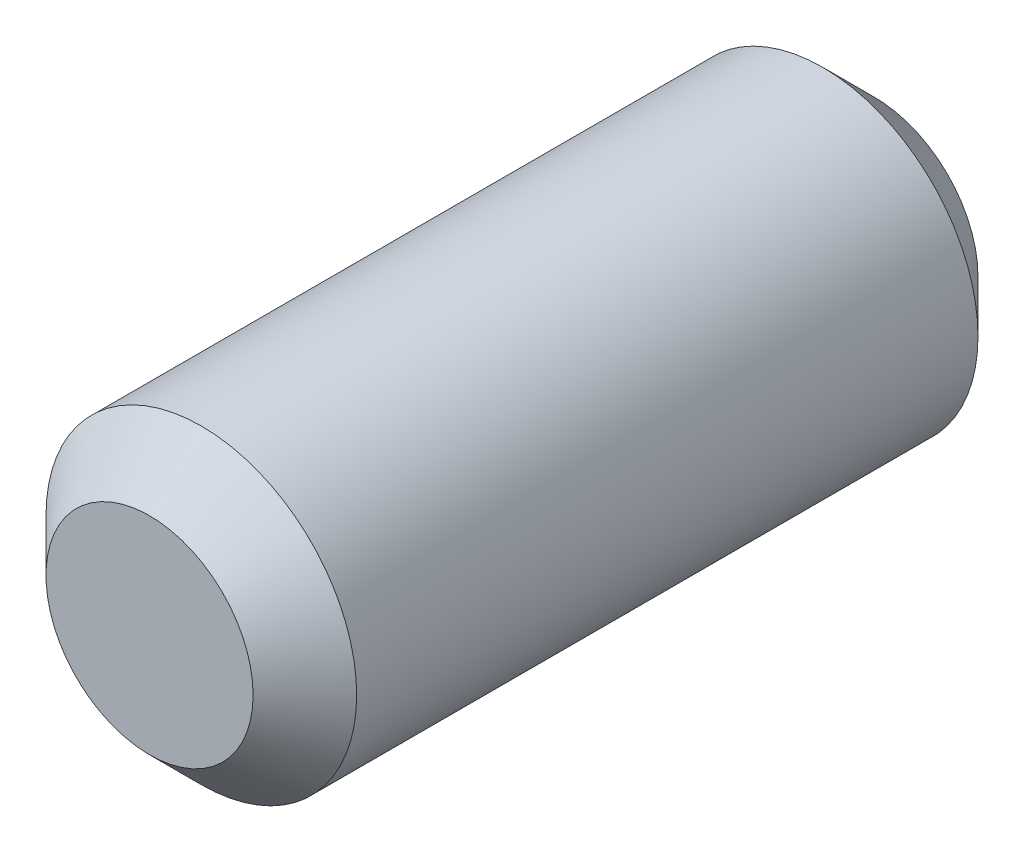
ISO-10303-21;
HEADER;
FILE_DESCRIPTION(('STEP AP214'),'2;1');
FILE_NAME('part.step','',(''),(''),'','','');
FILE_SCHEMA(('AUTOMOTIVE_DESIGN { 1 0 10303 214 1 1 1 1 }'));
ENDSEC;
DATA;
#1=APPLICATION_CONTEXT('core data for automotive mechanical design processes');
#2=APPLICATION_PROTOCOL_DEFINITION('international standard','automotive_design',2000,#1);
#3=PRODUCT_CONTEXT('',#1,'mechanical');
#4=PRODUCT('Part','Part','',(#3));
#5=PRODUCT_RELATED_PRODUCT_CATEGORY('part','',(#4));
#6=PRODUCT_DEFINITION_FORMATION('','',#4);
#7=PRODUCT_DEFINITION_CONTEXT('part definition',#1,'design');
#8=PRODUCT_DEFINITION('design','',#6,#7);
#9=PRODUCT_DEFINITION_SHAPE('','',#8);
#10=(LENGTH_UNIT() NAMED_UNIT(*) SI_UNIT(.MILLI.,.METRE.));
#11=(NAMED_UNIT(*) PLANE_ANGLE_UNIT() SI_UNIT($,.RADIAN.));
#12=(NAMED_UNIT(*) SI_UNIT($,.STERADIAN.) SOLID_ANGLE_UNIT());
#13=UNCERTAINTY_MEASURE_WITH_UNIT(LENGTH_MEASURE(1.E-05),#10,'distance_accuracy_value','');
#14=(GEOMETRIC_REPRESENTATION_CONTEXT(3) GLOBAL_UNCERTAINTY_ASSIGNED_CONTEXT((#13)) GLOBAL_UNIT_ASSIGNED_CONTEXT((#10,
#11,#12)) REPRESENTATION_CONTEXT('',''));
#15=CARTESIAN_POINT('',(0.,0.,0.));
#16=DIRECTION('',(0.,0.,1.));
#17=DIRECTION('',(1.,0.,0.));
#18=AXIS2_PLACEMENT_3D('',#15,#16,#17);
#19=CARTESIAN_POINT('',(0.,0.,7.));
#20=DIRECTION('',(0.,0.,-1.));
#21=DIRECTION('',(-1.,0.,0.));
#22=AXIS2_PLACEMENT_3D('',#19,#20,#21);
#23=CYLINDRICAL_SURFACE('',#22,1.5);
#24=CARTESIAN_POINT('',(0.,0.,0.500000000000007));
#25=DIRECTION('',(0.,0.,1.));
#26=DIRECTION('',(1.,0.,0.));
#27=AXIS2_PLACEMENT_3D('',#24,#25,#26);
#28=CIRCLE('',#27,1.5);
#29=CARTESIAN_POINT('',(1.5,0.,0.500000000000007));
#30=VERTEX_POINT('',#29);
#31=EDGE_CURVE('E38',#30,#30,#28,.T.);
#32=ORIENTED_EDGE('',*,*,#31,.T.);
#33=EDGE_LOOP('',(#32));
#34=FACE_BOUND('',#33,.T.);
#35=CARTESIAN_POINT('',(0.,0.,6.5));
#36=DIRECTION('',(0.,0.,1.));
#37=DIRECTION('',(1.,0.,0.));
#38=AXIS2_PLACEMENT_3D('',#35,#36,#37);
#39=CIRCLE('',#38,1.5);
#40=CARTESIAN_POINT('',(1.5,0.,6.5));
#41=VERTEX_POINT('',#40);
#42=EDGE_CURVE('E42',#41,#41,#39,.F.);
#43=ORIENTED_EDGE('',*,*,#42,.T.);
#44=EDGE_LOOP('',(#43));
#45=FACE_BOUND('',#44,.T.);
#46=ADVANCED_FACE('F28',(#34,#45),#23,.T.);
#47=CARTESIAN_POINT('',(0.,0.,7.));
#48=DIRECTION('',(0.,0.,1.));
#49=DIRECTION('',(1.,0.,0.));
#50=AXIS2_PLACEMENT_3D('',#47,#48,#49);
#51=PLANE('',#50);
#52=CARTESIAN_POINT('',(0.,0.,7.));
#53=DIRECTION('',(0.,0.,1.));
#54=DIRECTION('',(1.,0.,0.));
#55=AXIS2_PLACEMENT_3D('',#52,#53,#54);
#56=CIRCLE('',#55,0.999999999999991);
#57=CARTESIAN_POINT('',(0.999999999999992,0.,7.));
#58=VERTEX_POINT('',#57);
#59=EDGE_CURVE('E10',#58,#58,#56,.T.);
#60=ORIENTED_EDGE('',*,*,#59,.T.);
#61=EDGE_LOOP('',(#60));
#62=FACE_BOUND('',#61,.T.);
#63=ADVANCED_FACE('F60',(#62),#51,.T.);
#64=CARTESIAN_POINT('',(0.,0.,0.));
#65=DIRECTION('',(0.,0.,1.));
#66=DIRECTION('',(1.,0.,0.));
#67=AXIS2_PLACEMENT_3D('',#64,#65,#66);
#68=PLANE('',#67);
#69=CARTESIAN_POINT('',(0.,0.,0.));
#70=DIRECTION('',(0.,0.,1.));
#71=DIRECTION('',(1.,0.,0.));
#72=AXIS2_PLACEMENT_3D('',#69,#70,#71);
#73=CIRCLE('',#72,0.999999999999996);
#74=CARTESIAN_POINT('',(0.999999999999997,0.,0.));
#75=VERTEX_POINT('',#74);
#76=EDGE_CURVE('E34',#75,#75,#73,.F.);
#77=ORIENTED_EDGE('',*,*,#76,.T.);
#78=EDGE_LOOP('',(#77));
#79=FACE_BOUND('',#78,.T.);
#80=ADVANCED_FACE('F57',(#79),#68,.F.);
#81=CARTESIAN_POINT('',(0.,0.,0.500000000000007));
#82=DIRECTION('',(0.,0.,1.));
#83=DIRECTION('',(1.,0.,0.));
#84=AXIS2_PLACEMENT_3D('',#81,#82,#83);
#85=CONICAL_SURFACE('',#84,1.5,0.785398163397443);
#86=ORIENTED_EDGE('',*,*,#76,.F.);
#87=EDGE_LOOP('',(#86));
#88=FACE_BOUND('',#87,.T.);
#89=ORIENTED_EDGE('',*,*,#31,.F.);
#90=EDGE_LOOP('',(#89));
#91=FACE_BOUND('',#90,.T.);
#92=ADVANCED_FACE('F52',(#88,#91),#85,.T.);
#93=CARTESIAN_POINT('',(0.,0.,7.));
#94=DIRECTION('',(0.,0.,-1.));
#95=DIRECTION('',(-1.,0.,0.));
#96=AXIS2_PLACEMENT_3D('',#93,#94,#95);
#97=CONICAL_SURFACE('',#96,0.999999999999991,0.785398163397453);
#98=ORIENTED_EDGE('',*,*,#42,.F.);
#99=EDGE_LOOP('',(#98));
#100=FACE_BOUND('',#99,.T.);
#101=ORIENTED_EDGE('',*,*,#59,.F.);
#102=EDGE_LOOP('',(#101));
#103=FACE_BOUND('',#102,.T.);
#104=ADVANCED_FACE('F49',(#100,#103),#97,.T.);
#105=CLOSED_SHELL('',(#46,#63,#80,#92,#104));
#106=MANIFOLD_SOLID_BREP('B2',#105);
#107=ADVANCED_BREP_SHAPE_REPRESENTATION('',(#18,#106),#14);
#108=SHAPE_DEFINITION_REPRESENTATION(#9,#107);
ENDSEC;
END-ISO-10303-21;
